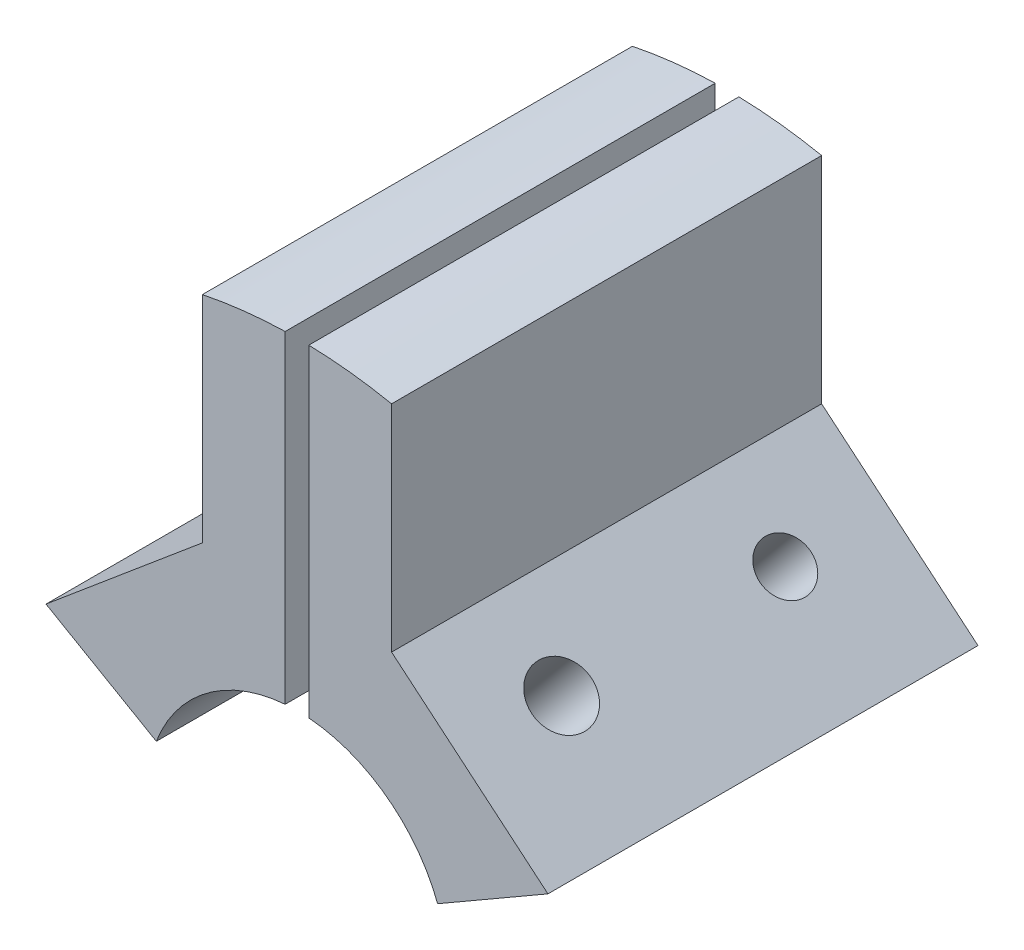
ISO-10303-21;
HEADER;
FILE_DESCRIPTION(('STEP AP214'),'2;1');
FILE_NAME('part.step','',(''),(''),'','','');
FILE_SCHEMA(('AUTOMOTIVE_DESIGN { 1 0 10303 214 1 1 1 1 }'));
ENDSEC;
DATA;
#1=APPLICATION_CONTEXT('core data for automotive mechanical design processes');
#2=APPLICATION_PROTOCOL_DEFINITION('international standard','automotive_design',2000,#1);
#3=PRODUCT_CONTEXT('',#1,'mechanical');
#4=PRODUCT('Part','Part','',(#3));
#5=PRODUCT_RELATED_PRODUCT_CATEGORY('part','',(#4));
#6=PRODUCT_DEFINITION_FORMATION('','',#4);
#7=PRODUCT_DEFINITION_CONTEXT('part definition',#1,'design');
#8=PRODUCT_DEFINITION('design','',#6,#7);
#9=PRODUCT_DEFINITION_SHAPE('','',#8);
#10=(LENGTH_UNIT() NAMED_UNIT(*) SI_UNIT(.MILLI.,.METRE.));
#11=(NAMED_UNIT(*) PLANE_ANGLE_UNIT() SI_UNIT($,.RADIAN.));
#12=(NAMED_UNIT(*) SI_UNIT($,.STERADIAN.) SOLID_ANGLE_UNIT());
#13=UNCERTAINTY_MEASURE_WITH_UNIT(LENGTH_MEASURE(1.E-05),#10,'distance_accuracy_value','');
#14=(GEOMETRIC_REPRESENTATION_CONTEXT(3) GLOBAL_UNCERTAINTY_ASSIGNED_CONTEXT((#13)) GLOBAL_UNIT_ASSIGNED_CONTEXT((#10,
#11,#12)) REPRESENTATION_CONTEXT('',''));
#15=CARTESIAN_POINT('',(0.,0.,0.));
#16=DIRECTION('',(0.,0.,1.));
#17=DIRECTION('',(1.,0.,0.));
#18=AXIS2_PLACEMENT_3D('',#15,#16,#17);
#19=CARTESIAN_POINT('',(0.,0.,25.));
#20=DIRECTION('',(0.,0.,1.));
#21=DIRECTION('',(1.,0.,0.));
#22=AXIS2_PLACEMENT_3D('',#19,#20,#21);
#23=PLANE('',#22);
#24=CARTESIAN_POINT('',(0.,0.,25.));
#25=DIRECTION('',(0.,0.,1.));
#26=DIRECTION('',(1.,0.,0.));
#27=AXIS2_PLACEMENT_3D('',#24,#25,#26);
#28=CIRCLE('',#27,17.5);
#29=CARTESIAN_POINT('',(-1.375,17.4458985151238,25.));
#30=VERTEX_POINT('',#29);
#31=CARTESIAN_POINT('',(-16.3532279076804,6.23072523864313,25.));
#32=VERTEX_POINT('',#31);
#33=EDGE_CURVE('E323',#30,#32,#28,.T.);
#34=ORIENTED_EDGE('',*,*,#33,.F.);
#35=DIRECTION('',(0.,-1.,0.));
#36=VECTOR('',#35,1.);
#37=CARTESIAN_POINT('',(-1.37499999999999,0.,25.));
#38=LINE('',#37,#36);
#39=CARTESIAN_POINT('',(-1.375,54.9828098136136,25.));
#40=VERTEX_POINT('',#39);
#41=EDGE_CURVE('E322',#40,#30,#38,.T.);
#42=ORIENTED_EDGE('',*,*,#41,.F.);
#43=CARTESIAN_POINT('',(0.,0.,25.));
#44=DIRECTION('',(0.,0.,1.));
#45=DIRECTION('',(1.,0.,0.));
#46=AXIS2_PLACEMENT_3D('',#43,#44,#45);
#47=CIRCLE('',#46,55.);
#48=CARTESIAN_POINT('',(-11.,53.8887743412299,25.));
#49=VERTEX_POINT('',#48);
#50=EDGE_CURVE('E404',#40,#49,#47,.T.);
#51=ORIENTED_EDGE('',*,*,#50,.T.);
#52=DIRECTION('',(0.,-1.,0.));
#53=VECTOR('',#52,1.);
#54=CARTESIAN_POINT('',(-11.,0.,25.));
#55=LINE('',#54,#53);
#56=CARTESIAN_POINT('',(-11.,28.8887743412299,25.));
#57=VERTEX_POINT('',#56);
#58=EDGE_CURVE('E408',#49,#57,#55,.T.);
#59=ORIENTED_EDGE('',*,*,#58,.T.);
#60=DIRECTION('',(-0.766044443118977,-0.642787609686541,0.));
#61=VECTOR('',#60,1.);
#62=CARTESIAN_POINT('',(-18.7698794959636,22.3690713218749,25.));
#63=LINE('',#62,#61);
#64=CARTESIAN_POINT('',(-29.1783603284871,13.6353188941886,25.));
#65=VERTEX_POINT('',#64);
#66=EDGE_CURVE('E331',#57,#65,#63,.T.);
#67=ORIENTED_EDGE('',*,*,#66,.T.);
#68=DIRECTION('',(0.866025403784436,-0.500000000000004,0.));
#69=VECTOR('',#68,1.);
#70=CARTESIAN_POINT('',(-1.39032380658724,-2.40811147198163,25.));
#71=LINE('',#70,#69);
#72=EDGE_CURVE('E326',#65,#32,#71,.T.);
#73=ORIENTED_EDGE('',*,*,#72,.T.);
#74=EDGE_LOOP('',(#34,#42,#51,#59,#67,#73));
#75=FACE_BOUND('',#74,.T.);
#76=ADVANCED_FACE('F43',(#75),#23,.T.);
#77=CARTESIAN_POINT('',(0.,0.,-25.));
#78=DIRECTION('',(0.,0.,1.));
#79=DIRECTION('',(1.,0.,0.));
#80=AXIS2_PLACEMENT_3D('',#77,#78,#79);
#81=PLANE('',#80);
#82=CARTESIAN_POINT('',(0.,0.,-25.));
#83=DIRECTION('',(0.,0.,1.));
#84=DIRECTION('',(1.,0.,0.));
#85=AXIS2_PLACEMENT_3D('',#82,#83,#84);
#86=CIRCLE('',#85,55.);
#87=CARTESIAN_POINT('',(-1.375,54.9828098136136,-25.));
#88=VERTEX_POINT('',#87);
#89=CARTESIAN_POINT('',(-11.,53.8887743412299,-25.));
#90=VERTEX_POINT('',#89);
#91=EDGE_CURVE('E352',#88,#90,#86,.T.);
#92=ORIENTED_EDGE('',*,*,#91,.F.);
#93=DIRECTION('',(0.,-1.,0.));
#94=VECTOR('',#93,1.);
#95=CARTESIAN_POINT('',(-1.37499999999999,0.,-25.));
#96=LINE('',#95,#94);
#97=CARTESIAN_POINT('',(-1.375,17.4458985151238,-25.));
#98=VERTEX_POINT('',#97);
#99=EDGE_CURVE('E346',#88,#98,#96,.T.);
#100=ORIENTED_EDGE('',*,*,#99,.T.);
#101=CARTESIAN_POINT('',(0.,0.,-25.));
#102=DIRECTION('',(0.,0.,1.));
#103=DIRECTION('',(1.,0.,0.));
#104=AXIS2_PLACEMENT_3D('',#101,#102,#103);
#105=CIRCLE('',#104,17.5);
#106=CARTESIAN_POINT('',(-16.3532279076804,6.23072523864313,-25.));
#107=VERTEX_POINT('',#106);
#108=EDGE_CURVE('E354',#98,#107,#105,.T.);
#109=ORIENTED_EDGE('',*,*,#108,.T.);
#110=DIRECTION('',(0.866025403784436,-0.500000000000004,0.));
#111=VECTOR('',#110,1.);
#112=CARTESIAN_POINT('',(-1.39032380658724,-2.40811147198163,-25.));
#113=LINE('',#112,#111);
#114=CARTESIAN_POINT('',(-29.1783603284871,13.6353188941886,-25.));
#115=VERTEX_POINT('',#114);
#116=EDGE_CURVE('E359',#115,#107,#113,.T.);
#117=ORIENTED_EDGE('',*,*,#116,.F.);
#118=DIRECTION('',(-0.766044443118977,-0.642787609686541,0.));
#119=VECTOR('',#118,1.);
#120=CARTESIAN_POINT('',(-18.7698794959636,22.3690713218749,-25.));
#121=LINE('',#120,#119);
#122=CARTESIAN_POINT('',(-11.,28.8887743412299,-25.));
#123=VERTEX_POINT('',#122);
#124=EDGE_CURVE('E360',#123,#115,#121,.T.);
#125=ORIENTED_EDGE('',*,*,#124,.F.);
#126=DIRECTION('',(0.,-1.,0.));
#127=VECTOR('',#126,1.);
#128=CARTESIAN_POINT('',(-11.,0.,-25.));
#129=LINE('',#128,#127);
#130=EDGE_CURVE('E351',#90,#123,#129,.T.);
#131=ORIENTED_EDGE('',*,*,#130,.F.);
#132=EDGE_LOOP('',(#92,#100,#109,#117,#125,#131));
#133=FACE_BOUND('',#132,.T.);
#134=ADVANCED_FACE('F255',(#133),#81,.F.);
#135=CARTESIAN_POINT('',(0.,0.,25.));
#136=DIRECTION('',(0.,0.,-1.));
#137=DIRECTION('',(-1.,0.,0.));
#138=AXIS2_PLACEMENT_3D('',#135,#136,#137);
#139=CYLINDRICAL_SURFACE('',#138,55.);
#140=ORIENTED_EDGE('',*,*,#91,.T.);
#141=DIRECTION('',(0.,0.,-1.));
#142=VECTOR('',#141,1.);
#143=CARTESIAN_POINT('',(-11.,53.8887743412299,25.));
#144=LINE('',#143,#142);
#145=EDGE_CURVE('E60',#49,#90,#144,.T.);
#146=ORIENTED_EDGE('',*,*,#145,.F.);
#147=ORIENTED_EDGE('',*,*,#50,.F.);
#148=DIRECTION('',(0.,0.,-1.));
#149=VECTOR('',#148,1.);
#150=CARTESIAN_POINT('',(-1.375,54.9828098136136,25.));
#151=LINE('',#150,#149);
#152=EDGE_CURVE('E11',#40,#88,#151,.T.);
#153=ORIENTED_EDGE('',*,*,#152,.T.);
#154=EDGE_LOOP('',(#140,#146,#147,#153));
#155=FACE_BOUND('',#154,.T.);
#156=ADVANCED_FACE('F44',(#155),#139,.T.);
#157=CARTESIAN_POINT('',(-11.,0.,25.));
#158=DIRECTION('',(1.,0.,0.));
#159=DIRECTION('',(0.,1.,0.));
#160=AXIS2_PLACEMENT_3D('',#157,#158,#159);
#161=PLANE('',#160);
#162=ORIENTED_EDGE('',*,*,#130,.T.);
#163=DIRECTION('',(0.,0.,-1.));
#164=VECTOR('',#163,1.);
#165=CARTESIAN_POINT('',(-11.,28.8887743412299,25.));
#166=LINE('',#165,#164);
#167=EDGE_CURVE('E217',#57,#123,#166,.T.);
#168=ORIENTED_EDGE('',*,*,#167,.F.);
#169=ORIENTED_EDGE('',*,*,#58,.F.);
#170=ORIENTED_EDGE('',*,*,#145,.T.);
#171=EDGE_LOOP('',(#162,#168,#169,#170));
#172=FACE_BOUND('',#171,.T.);
#173=ADVANCED_FACE('F424',(#172),#161,.F.);
#174=CARTESIAN_POINT('',(-18.7698794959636,22.3690713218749,25.));
#175=DIRECTION('',(0.642787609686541,-0.766044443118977,0.));
#176=DIRECTION('',(0.766044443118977,0.642787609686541,0.));
#177=AXIS2_PLACEMENT_3D('',#174,#175,#176);
#178=PLANE('',#177);
#179=CARTESIAN_POINT('',(-18.7698794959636,22.3690713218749,13.));
#180=DIRECTION('',(-0.642787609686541,0.766044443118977,0.));
#181=DIRECTION('',(-0.766044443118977,-0.642787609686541,0.));
#182=AXIS2_PLACEMENT_3D('',#179,#180,#181);
#183=CIRCLE('',#182,3.);
#184=CARTESIAN_POINT('',(-21.0680128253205,20.4407084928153,13.));
#185=VERTEX_POINT('',#184);
#186=EDGE_CURVE('E227',#185,#185,#183,.T.);
#187=ORIENTED_EDGE('',*,*,#186,.F.);
#188=EDGE_LOOP('',(#187));
#189=FACE_BOUND('',#188,.T.);
#190=CARTESIAN_POINT('',(-18.7698794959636,22.3690713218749,-13.));
#191=DIRECTION('',(-0.642787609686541,0.766044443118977,0.));
#192=DIRECTION('',(-0.766044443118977,-0.642787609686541,0.));
#193=AXIS2_PLACEMENT_3D('',#190,#191,#192);
#194=CIRCLE('',#193,3.5);
#195=CARTESIAN_POINT('',(-21.45103504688,20.119314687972,-13.));
#196=VERTEX_POINT('',#195);
#197=EDGE_CURVE('E297',#196,#196,#194,.T.);
#198=ORIENTED_EDGE('',*,*,#197,.F.);
#199=EDGE_LOOP('',(#198));
#200=FACE_BOUND('',#199,.T.);
#201=ORIENTED_EDGE('',*,*,#124,.T.);
#202=DIRECTION('',(0.,0.,-1.));
#203=VECTOR('',#202,1.);
#204=CARTESIAN_POINT('',(-29.1783603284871,13.6353188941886,25.));
#205=LINE('',#204,#203);
#206=EDGE_CURVE('E214',#65,#115,#205,.T.);
#207=ORIENTED_EDGE('',*,*,#206,.F.);
#208=ORIENTED_EDGE('',*,*,#66,.F.);
#209=ORIENTED_EDGE('',*,*,#167,.T.);
#210=EDGE_LOOP('',(#201,#207,#208,#209));
#211=FACE_BOUND('',#210,.T.);
#212=ADVANCED_FACE('F415',(#189,#200,#211),#178,.F.);
#213=CARTESIAN_POINT('',(-1.39032380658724,-2.40811147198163,25.));
#214=DIRECTION('',(0.500000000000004,0.866025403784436,0.));
#215=DIRECTION('',(-0.866025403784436,0.500000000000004,0.));
#216=AXIS2_PLACEMENT_3D('',#213,#214,#215);
#217=PLANE('',#216);
#218=ORIENTED_EDGE('',*,*,#116,.T.);
#219=DIRECTION('',(0.,0.,-1.));
#220=VECTOR('',#219,1.);
#221=CARTESIAN_POINT('',(-16.3532279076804,6.23072523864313,25.));
#222=LINE('',#221,#220);
#223=EDGE_CURVE('E213',#32,#107,#222,.T.);
#224=ORIENTED_EDGE('',*,*,#223,.F.);
#225=ORIENTED_EDGE('',*,*,#72,.F.);
#226=ORIENTED_EDGE('',*,*,#206,.T.);
#227=EDGE_LOOP('',(#218,#224,#225,#226));
#228=FACE_BOUND('',#227,.T.);
#229=ADVANCED_FACE('F418',(#228),#217,.F.);
#230=CARTESIAN_POINT('',(0.,0.,25.));
#231=DIRECTION('',(0.,0.,-1.));
#232=DIRECTION('',(-1.,0.,0.));
#233=AXIS2_PLACEMENT_3D('',#230,#231,#232);
#234=CYLINDRICAL_SURFACE('',#233,17.5);
#235=CARTESIAN_POINT('',(-13.3803957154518,11.2789631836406,13.));
#236=CARTESIAN_POINT('',(-13.3803925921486,11.2789698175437,12.832822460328));
#237=CARTESIAN_POINT('',(-13.3712345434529,11.2898589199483,12.6655553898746));
#238=CARTESIAN_POINT('',(-13.3347302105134,11.3329491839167,12.3357195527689));
#239=CARTESIAN_POINT('',(-13.3073674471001,11.3651696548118,12.1731551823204));
#240=CARTESIAN_POINT('',(-13.2349197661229,11.4494526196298,11.8575457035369));
#241=CARTESIAN_POINT('',(-13.1898500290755,11.5014981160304,11.7044925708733));
#242=CARTESIAN_POINT('',(-13.0827184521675,11.6232104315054,11.4119792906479));
#243=CARTESIAN_POINT('',(-13.0206583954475,11.692875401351,11.2725177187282));
#244=CARTESIAN_POINT('',(-12.8798925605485,11.8477588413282,11.0096776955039));
#245=CARTESIAN_POINT('',(-12.8010368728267,11.9331163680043,10.8864614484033));
#246=CARTESIAN_POINT('',(-12.628401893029,12.1156599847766,10.6610195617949));
#247=CARTESIAN_POINT('',(-12.5346216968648,12.2128467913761,10.5587951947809));
#248=CARTESIAN_POINT('',(-12.3332938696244,12.4161356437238,10.3776271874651));
#249=CARTESIAN_POINT('',(-12.2256628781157,12.5222902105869,10.2988349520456));
#250=CARTESIAN_POINT('',(-11.9994639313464,12.7392067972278,10.167741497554));
#251=CARTESIAN_POINT('',(-11.8808967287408,12.8499684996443,10.1154384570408));
#252=CARTESIAN_POINT('',(-11.6369617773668,13.0712647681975,10.0393054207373));
#253=CARTESIAN_POINT('',(-11.5116716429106,13.1817910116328,10.0152026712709));
#254=CARTESIAN_POINT('',(-11.2566481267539,13.4002257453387,9.99530588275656));
#255=CARTESIAN_POINT('',(-11.1269150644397,13.5081344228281,9.99950981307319));
#256=CARTESIAN_POINT('',(-10.8681793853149,13.7171446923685,10.0358951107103));
#257=CARTESIAN_POINT('',(-10.7391833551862,13.818305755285,10.0677829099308));
#258=CARTESIAN_POINT('',(-10.4844757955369,14.0125456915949,10.15816805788));
#259=CARTESIAN_POINT('',(-10.3587643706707,14.1056243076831,10.2166662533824));
#260=CARTESIAN_POINT('',(-10.1139880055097,14.282161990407,10.3589007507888));
#261=CARTESIAN_POINT('',(-9.99495798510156,14.3655725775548,10.4427572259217));
#262=CARTESIAN_POINT('',(-9.76807650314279,14.520799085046,10.6332397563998));
#263=CARTESIAN_POINT('',(-9.66022599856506,14.5926140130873,10.7398677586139));
#264=CARTESIAN_POINT('',(-9.45805720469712,14.72446719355,10.9744925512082));
#265=CARTESIAN_POINT('',(-9.363930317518,14.7843425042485,11.1027459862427));
#266=CARTESIAN_POINT('',(-9.19429851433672,14.8904303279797,11.3761184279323));
#267=CARTESIAN_POINT('',(-9.11879378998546,14.9366427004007,11.5212376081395));
#268=CARTESIAN_POINT('',(-8.98922339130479,15.0149801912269,11.8245227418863));
#269=CARTESIAN_POINT('',(-8.93518433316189,15.0470878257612,11.9827046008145));
#270=CARTESIAN_POINT('',(-8.85088829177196,15.0968273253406,12.3074567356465));
#271=CARTESIAN_POINT('',(-8.82062908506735,15.1144605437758,12.4740262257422));
#272=CARTESIAN_POINT('',(-8.78539812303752,15.1349659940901,12.8085724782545));
#273=CARTESIAN_POINT('',(-8.78011186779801,15.1380218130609,12.9765049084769));
#274=CARTESIAN_POINT('',(-8.7941954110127,15.1298443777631,13.3109762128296));
#275=CARTESIAN_POINT('',(-8.81356419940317,15.118611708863,13.4775151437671));
#276=CARTESIAN_POINT('',(-8.87592829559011,15.0820812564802,13.8033231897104));
#277=CARTESIAN_POINT('',(-8.91876351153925,15.0568787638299,13.9626337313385));
#278=CARTESIAN_POINT('',(-9.02623441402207,14.9926977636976,14.2707801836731));
#279=CARTESIAN_POINT('',(-9.09087147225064,14.9537183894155,14.4196154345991));
#280=CARTESIAN_POINT('',(-9.24021488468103,14.8619029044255,14.7041803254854));
#281=CARTESIAN_POINT('',(-9.32511047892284,14.808935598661,14.839768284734));
#282=CARTESIAN_POINT('',(-9.51152330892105,14.6898987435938,15.0925224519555));
#283=CARTESIAN_POINT('',(-9.61304178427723,14.6238282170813,15.2096872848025));
#284=CARTESIAN_POINT('',(-9.83037122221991,14.4786406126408,15.4235865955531));
#285=CARTESIAN_POINT('',(-9.94632759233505,14.3993875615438,15.5200812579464));
#286=CARTESIAN_POINT('',(-10.1876671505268,14.2296581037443,15.6882185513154));
#287=CARTESIAN_POINT('',(-10.313050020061,14.139182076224,15.7598620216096));
#288=CARTESIAN_POINT('',(-10.5685047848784,13.9492616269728,15.8758931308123));
#289=CARTESIAN_POINT('',(-10.698552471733,13.8498603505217,15.9204045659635));
#290=CARTESIAN_POINT('',(-10.9597319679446,13.6441156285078,15.9813060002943));
#291=CARTESIAN_POINT('',(-11.0908636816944,13.53777278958,15.9976984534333));
#292=CARTESIAN_POINT('',(-11.34856115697,13.3224620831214,16.0018227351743));
#293=CARTESIAN_POINT('',(-11.4751638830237,13.2135452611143,15.9899188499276));
#294=CARTESIAN_POINT('',(-11.7220389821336,12.9950369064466,15.9385784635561));
#295=CARTESIAN_POINT('',(-11.8423113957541,12.8854453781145,15.89914213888));
#296=CARTESIAN_POINT('',(-12.0733533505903,12.6692211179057,15.7939992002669));
#297=CARTESIAN_POINT('',(-12.1841345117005,12.5625848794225,15.7283252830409));
#298=CARTESIAN_POINT('',(-12.3938950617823,12.3556907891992,15.5726125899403));
#299=CARTESIAN_POINT('',(-12.492873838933,12.2554332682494,15.4825725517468));
#300=CARTESIAN_POINT('',(-12.678191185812,12.0636433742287,15.2794002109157));
#301=CARTESIAN_POINT('',(-12.7643624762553,11.972231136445,15.1660018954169));
#302=CARTESIAN_POINT('',(-12.921071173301,11.802934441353,14.9198890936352));
#303=CARTESIAN_POINT('',(-12.9916049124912,11.7250531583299,14.7871700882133));
#304=CARTESIAN_POINT('',(-13.116297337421,11.5854046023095,14.5049934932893));
#305=CARTESIAN_POINT('',(-13.1703286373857,11.5237631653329,14.3554173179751));
#306=CARTESIAN_POINT('',(-13.2603545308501,11.4200592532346,14.0446231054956));
#307=CARTESIAN_POINT('',(-13.2963669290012,11.3779774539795,13.8834167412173));
#308=CARTESIAN_POINT('',(-13.3421437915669,11.3242231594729,13.601345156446));
#309=CARTESIAN_POINT('',(-13.3564746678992,11.307289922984,13.482176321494));
#310=CARTESIAN_POINT('',(-13.3756016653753,11.2846576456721,13.2420206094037));
#311=CARTESIAN_POINT('',(-13.3803979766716,11.2789583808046,13.1210337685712));
#312=CARTESIAN_POINT('',(-13.3803957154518,11.2789631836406,13.));
#313=B_SPLINE_CURVE_WITH_KNOTS('',3,(#235,#236,#237,#238,#239,#240,#241,#242,#243,#244,#245,
#246,#247,#248,#249,#250,#251,#252,#253,#254,#255,#256,#257,#258,#259,#260,#261,#262,#263,#264,
#265,#266,#267,#268,#269,#270,#271,#272,#273,#274,#275,#276,#277,#278,#279,#280,#281,#282,#283,
#284,#285,#286,#287,#288,#289,#290,#291,#292,#293,#294,#295,#296,#297,#298,#299,#300,#301,#302,
#303,#304,#305,#306,#307,#308,#309,#310,#311,#312),.UNSPECIFIED.,.T.,.F.,(4,2,2,2,2,2,2,2,2,2,2,
2,2,2,2,2,2,2,2,2,2,2,2,2,2,2,2,2,2,2,2,2,2,2,2,2,2,2,4),(0.,0.501089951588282,1.00263411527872,
1.50374923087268,2.00481177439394,2.51054946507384,3.01631780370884,3.52528645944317,
4.03422011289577,4.53818955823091,5.04212285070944,5.54077666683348,6.03944635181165,
6.54051729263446,7.04163109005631,7.54917511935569,8.05672437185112,8.56490100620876,
9.07303011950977,9.57474267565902,10.076434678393,10.5747459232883,11.0730885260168,
11.576282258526,12.0795135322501,12.588300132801,13.0970695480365,13.6034998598,
14.1098859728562,14.6097882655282,15.1096873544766,15.6089654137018,16.1082693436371,
16.6136095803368,17.1190682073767,17.6283353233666,18.1370982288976,18.4998862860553,
18.8626671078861),.UNSPECIFIED.);
#314=CARTESIAN_POINT('',(-13.3803957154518,11.2789631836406,13.));
#315=VERTEX_POINT('',#314);
#316=EDGE_CURVE('E50',#315,#315,#313,.T.);
#317=ORIENTED_EDGE('',*,*,#316,.F.);
#318=EDGE_LOOP('',(#317));
#319=FACE_BOUND('',#318,.T.);
#320=CARTESIAN_POINT('',(-13.7026671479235,10.885169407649,-13.));
#321=CARTESIAN_POINT('',(-13.702664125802,10.8851769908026,-13.194475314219));
#322=CARTESIAN_POINT('',(-13.692358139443,10.8981857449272,-13.3890411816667));
#323=CARTESIAN_POINT('',(-13.6512601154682,10.9496182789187,-13.772668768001));
#324=CARTESIAN_POINT('',(-13.620451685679,10.9880623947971,-13.9617259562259));
#325=CARTESIAN_POINT('',(-13.538812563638,11.0884945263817,-14.3287305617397));
#326=CARTESIAN_POINT('',(-13.4880017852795,11.1504591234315,-14.5066888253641));
#327=CARTESIAN_POINT('',(-13.3670576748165,11.2951591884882,-14.8468619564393));
#328=CARTESIAN_POINT('',(-13.2969254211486,11.3778934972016,-15.0090777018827));
#329=CARTESIAN_POINT('',(-13.137289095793,11.5618602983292,-15.3154635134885));
#330=CARTESIAN_POINT('',(-13.0475505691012,11.6633141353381,-15.4593785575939));
#331=CARTESIAN_POINT('',(-12.8505896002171,11.8799722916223,-15.7228513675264));
#332=CARTESIAN_POINT('',(-12.7433659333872,11.9951775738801,-15.8424074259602));
#333=CARTESIAN_POINT('',(-12.5122681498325,12.2360615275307,-16.0547580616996));
#334=CARTESIAN_POINT('',(-12.3882570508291,12.3618227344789,-16.1473102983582));
#335=CARTESIAN_POINT('',(-12.1268742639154,12.618336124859,-16.3014622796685));
#336=CARTESIAN_POINT('',(-11.9895038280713,12.7490878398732,-16.3630649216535));
#337=CARTESIAN_POINT('',(-11.7066009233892,13.0093015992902,-16.4527751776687));
#338=CARTESIAN_POINT('',(-11.5611998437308,13.1387579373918,-16.4813134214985));
#339=CARTESIAN_POINT('',(-11.2645430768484,13.3939663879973,-16.5054283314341));
#340=CARTESIAN_POINT('',(-11.1132879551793,13.5197188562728,-16.5010081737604));
#341=CARTESIAN_POINT('',(-10.8115717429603,13.7621530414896,-16.4596583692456));
#342=CARTESIAN_POINT('',(-10.6611300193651,13.8789384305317,-16.4231925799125));
#343=CARTESIAN_POINT('',(-10.3634970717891,14.1025743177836,-16.3195223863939));
#344=CARTESIAN_POINT('',(-10.2163059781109,14.2094244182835,-16.2523167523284));
#345=CARTESIAN_POINT('',(-9.92893028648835,14.4117121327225,-16.0886448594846));
#346=CARTESIAN_POINT('',(-9.78879568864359,14.5070735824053,-15.9919968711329));
#347=CARTESIAN_POINT('',(-9.52113409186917,14.6841342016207,-15.7723182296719));
#348=CARTESIAN_POINT('',(-9.39360854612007,14.7658317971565,-15.6492845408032));
#349=CARTESIAN_POINT('',(-9.15344281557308,14.9159284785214,-15.3777823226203));
#350=CARTESIAN_POINT('',(-9.04110082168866,14.984070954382,-15.2289078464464));
#351=CARTESIAN_POINT('',(-8.83816299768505,15.1046632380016,-14.9112924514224));
#352=CARTESIAN_POINT('',(-8.74756757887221,15.1571127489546,-14.7425511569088));
#353=CARTESIAN_POINT('',(-8.59156903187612,15.2460834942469,-14.3894270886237));
#354=CARTESIAN_POINT('',(-8.52622023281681,15.2825704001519,-14.2050116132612));
#355=CARTESIAN_POINT('',(-8.4238162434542,15.3392561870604,-13.826100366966));
#356=CARTESIAN_POINT('',(-8.38675736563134,15.3594571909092,-13.6316059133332));
#357=CARTESIAN_POINT('',(-8.34298651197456,15.383276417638,-13.2416229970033));
#358=CARTESIAN_POINT('',(-8.3357661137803,15.3871724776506,-13.0462084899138));
#359=CARTESIAN_POINT('',(-8.35059989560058,15.3791270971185,-12.6568312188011));
#360=CARTESIAN_POINT('',(-8.3726524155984,15.3671865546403,-12.462868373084));
#361=CARTESIAN_POINT('',(-8.44468986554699,15.3277152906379,-12.0838097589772));
#362=CARTESIAN_POINT('',(-8.49440492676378,15.3003351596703,-11.8986467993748));
#363=CARTESIAN_POINT('',(-8.61947986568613,15.2302224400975,-11.5402785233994));
#364=CARTESIAN_POINT('',(-8.69484185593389,15.1874885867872,-11.367074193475));
#365=CARTESIAN_POINT('',(-8.86937012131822,15.086236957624,-11.0350541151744));
#366=CARTESIAN_POINT('',(-8.96883386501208,15.0275207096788,-10.8764553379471));
#367=CARTESIAN_POINT('',(-9.18728321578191,14.894969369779,-10.5804209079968));
#368=CARTESIAN_POINT('',(-9.3062708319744,14.8211327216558,-10.4429874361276));
#369=CARTESIAN_POINT('',(-9.56150223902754,14.657794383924,-10.1910310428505));
#370=CARTESIAN_POINT('',(-9.69798289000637,14.5680696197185,-10.076892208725));
#371=CARTESIAN_POINT('',(-9.98195448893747,14.3749790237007,-9.87748941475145));
#372=CARTESIAN_POINT('',(-10.129444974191,14.2716137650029,-9.79222424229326));
#373=CARTESIAN_POINT('',(-10.4295784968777,14.0537557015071,-9.65354894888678));
#374=CARTESIAN_POINT('',(-10.5821869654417,13.9393304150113,-9.59995818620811));
#375=CARTESIAN_POINT('',(-10.8883796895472,13.70148664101,-9.52558063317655));
#376=CARTESIAN_POINT('',(-11.0419638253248,13.5780692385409,-9.50478989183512));
#377=CARTESIAN_POINT('',(-11.3426999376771,13.3278193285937,-9.49675556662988));
#378=CARTESIAN_POINT('',(-11.4899173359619,13.2010836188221,-9.5089345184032));
#379=CARTESIAN_POINT('',(-11.7766134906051,12.9459724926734,-9.56521882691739));
#380=CARTESIAN_POINT('',(-11.9160923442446,12.8175970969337,-9.60932378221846));
#381=CARTESIAN_POINT('',(-12.1835474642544,12.5636432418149,-9.72795147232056));
#382=CARTESIAN_POINT('',(-12.3115491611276,12.438059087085,-9.80240482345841));
#383=CARTESIAN_POINT('',(-12.5536908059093,12.1936246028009,-9.97954284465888));
#384=CARTESIAN_POINT('',(-12.6678296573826,12.0747748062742,-10.0822297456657));
#385=CARTESIAN_POINT('',(-12.8818884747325,11.8461764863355,-10.3148678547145));
#386=CARTESIAN_POINT('',(-12.9815493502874,11.7366057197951,-10.4452321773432));
#387=CARTESIAN_POINT('',(-13.1628318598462,11.5329308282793,-10.7286758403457));
#388=CARTESIAN_POINT('',(-13.2444492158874,11.4388303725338,-10.8817605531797));
#389=CARTESIAN_POINT('',(-13.3892124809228,11.2690551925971,-11.2082776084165));
#390=CARTESIAN_POINT('',(-13.4521499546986,11.1935898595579,-11.3819113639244));
#391=CARTESIAN_POINT('',(-13.5574173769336,11.0658636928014,-11.7432647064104));
#392=CARTESIAN_POINT('',(-13.5997660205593,11.0135818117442,-11.9309713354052));
#393=CARTESIAN_POINT('',(-13.6551887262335,10.9447340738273,-12.2659185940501));
#394=CARTESIAN_POINT('',(-13.6729773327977,10.9224564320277,-12.4112489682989));
#395=CARTESIAN_POINT('',(-13.6967174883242,10.8926714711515,-12.704368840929));
#396=CARTESIAN_POINT('',(-13.7026694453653,10.8851636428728,-12.8521582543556));
#397=CARTESIAN_POINT('',(-13.7026671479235,10.885169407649,-13.));
#398=B_SPLINE_CURVE_WITH_KNOTS('',3,(#320,#321,#322,#323,#324,#325,#326,#327,#328,#329,#330,
#331,#332,#333,#334,#335,#336,#337,#338,#339,#340,#341,#342,#343,#344,#345,#346,#347,#348,#349,
#350,#351,#352,#353,#354,#355,#356,#357,#358,#359,#360,#361,#362,#363,#364,#365,#366,#367,#368,
#369,#370,#371,#372,#373,#374,#375,#376,#377,#378,#379,#380,#381,#382,#383,#384,#385,#386,#387,
#388,#389,#390,#391,#392,#393,#394,#395,#396,#397),.UNSPECIFIED.,.T.,.F.,(4,2,2,2,2,2,2,2,2,2,2,
2,2,2,2,2,2,2,2,2,2,2,2,2,2,2,2,2,2,2,2,2,2,2,2,2,2,2,4),(0.,0.582884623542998,1.16623583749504,
1.74900774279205,2.33174712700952,2.92187883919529,3.51205190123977,4.10736901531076,
4.70263038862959,5.29004871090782,5.87741042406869,6.45640763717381,7.03542801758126,
7.61809734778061,8.20083375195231,8.79372713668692,9.38663173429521,9.98080521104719,
10.5749012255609,11.1588315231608,11.7427287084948,12.3210269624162,12.8993728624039,
13.4852570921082,14.0712016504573,14.6661410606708,15.2610554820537,15.8525434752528,
16.443960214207,17.025085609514,17.6062036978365,18.1860005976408,18.7658433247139,
19.3550403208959,19.9443768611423,20.5400614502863,21.1352041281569,21.5783331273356,
22.0214468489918),.UNSPECIFIED.);
#399=CARTESIAN_POINT('',(-13.7026671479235,10.885169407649,-13.));
#400=VERTEX_POINT('',#399);
#401=EDGE_CURVE('E225',#400,#400,#398,.T.);
#402=ORIENTED_EDGE('',*,*,#401,.F.);
#403=EDGE_LOOP('',(#402));
#404=FACE_BOUND('',#403,.T.);
#405=ORIENTED_EDGE('',*,*,#108,.F.);
#406=DIRECTION('',(0.,0.,-1.));
#407=VECTOR('',#406,1.);
#408=CARTESIAN_POINT('',(-1.375,17.4458985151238,25.));
#409=LINE('',#408,#407);
#410=EDGE_CURVE('E211',#30,#98,#409,.T.);
#411=ORIENTED_EDGE('',*,*,#410,.F.);
#412=ORIENTED_EDGE('',*,*,#33,.T.);
#413=ORIENTED_EDGE('',*,*,#223,.T.);
#414=EDGE_LOOP('',(#405,#411,#412,#413));
#415=FACE_BOUND('',#414,.T.);
#416=ADVANCED_FACE('F230',(#319,#404,#415),#234,.F.);
#417=CARTESIAN_POINT('',(-1.37499999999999,0.,25.));
#418=DIRECTION('',(1.,0.,0.));
#419=DIRECTION('',(0.,1.,0.));
#420=AXIS2_PLACEMENT_3D('',#417,#418,#419);
#421=PLANE('',#420);
#422=DIRECTION('',(0.,0.,-1.));
#423=VECTOR('',#422,1.);
#424=CARTESIAN_POINT('',(-1.375,50.2828098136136,25.));
#425=LINE('',#424,#423);
#426=CARTESIAN_POINT('',(-1.375,50.2828098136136,20.3));
#427=VERTEX_POINT('',#426);
#428=CARTESIAN_POINT('',(-1.375,50.2828098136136,-20.3));
#429=VERTEX_POINT('',#428);
#430=EDGE_CURVE('E177',#427,#429,#425,.T.);
#431=ORIENTED_EDGE('',*,*,#430,.T.);
#432=DIRECTION('',(0.,1.,0.));
#433=VECTOR('',#432,1.);
#434=CARTESIAN_POINT('',(-1.375,6.23072523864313,-20.3));
#435=LINE('',#434,#433);
#436=CARTESIAN_POINT('',(-1.375,22.1458985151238,-20.3));
#437=VERTEX_POINT('',#436);
#438=EDGE_CURVE('E161',#437,#429,#435,.T.);
#439=ORIENTED_EDGE('',*,*,#438,.F.);
#440=DIRECTION('',(0.,0.,-1.));
#441=VECTOR('',#440,1.);
#442=CARTESIAN_POINT('',(-1.375,22.1458985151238,25.));
#443=LINE('',#442,#441);
#444=CARTESIAN_POINT('',(-1.375,22.1458985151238,20.3));
#445=VERTEX_POINT('',#444);
#446=EDGE_CURVE('E207',#445,#437,#443,.T.);
#447=ORIENTED_EDGE('',*,*,#446,.F.);
#448=DIRECTION('',(0.,1.,0.));
#449=VECTOR('',#448,1.);
#450=CARTESIAN_POINT('',(-1.375,6.23072523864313,20.3));
#451=LINE('',#450,#449);
#452=EDGE_CURVE('E61',#445,#427,#451,.T.);
#453=ORIENTED_EDGE('',*,*,#452,.T.);
#454=EDGE_LOOP('',(#431,#439,#447,#453));
#455=FACE_BOUND('',#454,.T.);
#456=ORIENTED_EDGE('',*,*,#99,.F.);
#457=ORIENTED_EDGE('',*,*,#152,.F.);
#458=ORIENTED_EDGE('',*,*,#41,.T.);
#459=ORIENTED_EDGE('',*,*,#410,.T.);
#460=EDGE_LOOP('',(#456,#457,#458,#459));
#461=FACE_BOUND('',#460,.T.);
#462=ADVANCED_FACE('F182',(#455,#461),#421,.T.);
#463=CARTESIAN_POINT('',(0.,22.1458985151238,25.));
#464=DIRECTION('',(0.,1.,0.));
#465=DIRECTION('',(0.,0.,1.));
#466=AXIS2_PLACEMENT_3D('',#463,#464,#465);
#467=PLANE('',#466);
#468=ORIENTED_EDGE('',*,*,#446,.T.);
#469=DIRECTION('',(1.,0.,0.));
#470=VECTOR('',#469,1.);
#471=CARTESIAN_POINT('',(0.,22.1458985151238,-20.3));
#472=LINE('',#471,#470);
#473=CARTESIAN_POINT('',(1.375,22.1458985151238,-20.3));
#474=VERTEX_POINT('',#473);
#475=EDGE_CURVE('E167',#437,#474,#472,.T.);
#476=ORIENTED_EDGE('',*,*,#475,.T.);
#477=DIRECTION('',(0.,0.,-1.));
#478=VECTOR('',#477,1.);
#479=CARTESIAN_POINT('',(1.375,22.1458985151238,25.));
#480=LINE('',#479,#478);
#481=CARTESIAN_POINT('',(1.375,22.1458985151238,20.3));
#482=VERTEX_POINT('',#481);
#483=EDGE_CURVE('E206',#482,#474,#480,.T.);
#484=ORIENTED_EDGE('',*,*,#483,.F.);
#485=DIRECTION('',(-1.,0.,0.));
#486=VECTOR('',#485,1.);
#487=CARTESIAN_POINT('',(0.,22.1458985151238,20.3));
#488=LINE('',#487,#486);
#489=EDGE_CURVE('E395',#482,#445,#488,.T.);
#490=ORIENTED_EDGE('',*,*,#489,.T.);
#491=EDGE_LOOP('',(#468,#476,#484,#490));
#492=FACE_BOUND('',#491,.T.);
#493=ADVANCED_FACE('F283',(#492),#467,.F.);
#494=CARTESIAN_POINT('',(0.,0.,25.));
#495=DIRECTION('',(0.,0.,-1.));
#496=DIRECTION('',(-1.,0.,0.));
#497=AXIS2_PLACEMENT_3D('',#494,#495,#496);
#498=CYLINDRICAL_SURFACE('',#497,17.5);
#499=CARTESIAN_POINT('',(8.34035604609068,15.3846826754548,13.));
#500=CARTESIAN_POINT('',(8.34036403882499,15.3846810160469,12.805524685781));
#501=CARTESIAN_POINT('',(8.35496477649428,15.3767905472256,12.6109588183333));
#502=CARTESIAN_POINT('',(8.41275253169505,15.3452480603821,12.227331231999));
#503=CARTESIAN_POINT('',(8.4559624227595,15.3215834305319,12.0382740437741));
#504=CARTESIAN_POINT('',(8.56904524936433,15.2586244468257,11.6712694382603));
#505=CARTESIAN_POINT('',(8.63889166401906,15.2193456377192,11.4933111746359));
#506=CARTESIAN_POINT('',(8.80239513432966,15.1253658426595,11.1531380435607));
#507=CARTESIAN_POINT('',(8.8960508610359,15.0706657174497,10.9909222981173));
#508=CARTESIAN_POINT('',(9.1049433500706,14.9454001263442,10.6845364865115));
#509=CARTESIAN_POINT('',(9.22043880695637,14.8746422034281,10.5406214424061));
#510=CARTESIAN_POINT('',(9.4680073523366,14.7182958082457,10.2771486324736));
#511=CARTESIAN_POINT('',(9.60008160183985,14.6327062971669,10.1575925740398));
#512=CARTESIAN_POINT('',(9.87743569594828,14.4469484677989,9.9452419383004));
#513=CARTESIAN_POINT('',(10.0228206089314,14.3466595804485,9.85268970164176));
#514=CARTESIAN_POINT('',(10.3208256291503,14.1337908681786,9.69853772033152));
#515=CARTESIAN_POINT('',(10.4734450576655,14.0212121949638,9.63693507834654));
#516=CARTESIAN_POINT('',(10.7788311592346,13.7877928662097,9.54722482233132));
#517=CARTESIAN_POINT('',(10.9315693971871,13.6670806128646,9.51868657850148));
#518=CARTESIAN_POINT('',(11.2344145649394,13.4192472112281,9.4945716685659));
#519=CARTESIAN_POINT('',(11.3845217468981,13.2921266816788,9.49899182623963));
#520=CARTESIAN_POINT('',(11.6756652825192,13.0370924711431,9.54034163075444));
#521=CARTESIAN_POINT('',(11.8168003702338,12.9092158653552,9.57680742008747));
#522=CARTESIAN_POINT('',(12.0887221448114,12.6549385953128,9.68047761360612));
#523=CARTESIAN_POINT('',(12.2195084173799,12.5285379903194,9.74768324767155));
#524=CARTESIAN_POINT('',(12.4686251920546,12.2806550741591,9.91135514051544));
#525=CARTESIAN_POINT('',(12.5868720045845,12.1592087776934,10.0080031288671));
#526=CARTESIAN_POINT('',(12.8077216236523,11.9263598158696,10.2276817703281));
#527=CARTESIAN_POINT('',(12.9103226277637,11.8149583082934,10.3507154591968));
#528=CARTESIAN_POINT('',(13.0998433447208,11.6045052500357,10.6222176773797));
#529=CARTESIAN_POINT('',(13.1864585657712,11.5057028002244,10.7710921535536));
#530=CARTESIAN_POINT('',(13.3404585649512,11.3267886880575,11.0887075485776));
#531=CARTESIAN_POINT('',(13.4078429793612,11.2466773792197,11.2574488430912));
#532=CARTESIAN_POINT('',(13.5225509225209,11.108498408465,11.6105729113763));
#533=CARTESIAN_POINT('',(13.5698312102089,11.0504782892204,11.7949883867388));
#534=CARTESIAN_POINT('',(13.6434380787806,10.959473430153,12.173899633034));
#535=CARTESIAN_POINT('',(13.66976739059,10.9264854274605,12.3683940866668));
#536=CARTESIAN_POINT('',(13.7008254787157,10.8875157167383,12.7583770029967));
#537=CARTESIAN_POINT('',(13.7059161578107,10.881081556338,12.9537915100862));
#538=CARTESIAN_POINT('',(13.6954171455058,10.8942929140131,13.3431687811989));
#539=CARTESIAN_POINT('',(13.6798286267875,10.9139369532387,13.537131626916));
#540=CARTESIAN_POINT('',(13.6284478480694,10.978025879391,13.9161902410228));
#541=CARTESIAN_POINT('',(13.5928507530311,11.022231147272,14.1013532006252));
#542=CARTESIAN_POINT('',(13.5020841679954,11.1332309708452,14.4597214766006));
#543=CARTESIAN_POINT('',(13.4469130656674,11.2000273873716,14.632925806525));
#544=CARTESIAN_POINT('',(13.3168931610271,11.3543220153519,14.9649458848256));
#545=CARTESIAN_POINT('',(13.2417972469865,11.4420787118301,15.1235446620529));
#546=CARTESIAN_POINT('',(13.0733263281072,11.6341920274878,15.4195790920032));
#547=CARTESIAN_POINT('',(12.9799494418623,11.7385503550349,15.5570125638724));
#548=CARTESIAN_POINT('',(12.7747721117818,11.9615408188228,15.8089689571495));
#549=CARTESIAN_POINT('',(12.6627108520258,12.080367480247,15.923107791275));
#550=CARTESIAN_POINT('',(12.4232425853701,12.3264950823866,16.1225105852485));
#551=CARTESIAN_POINT('',(12.295836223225,12.4537956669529,16.2077757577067));
#552=CARTESIAN_POINT('',(12.0291702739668,12.7115388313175,16.3464510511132));
#553=CARTESIAN_POINT('',(11.8899831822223,12.8419590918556,16.4000418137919));
#554=CARTESIAN_POINT('',(11.6025829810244,13.1021989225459,16.4744193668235));
#555=CARTESIAN_POINT('',(11.4543709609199,13.2320185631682,16.4952101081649));
#556=CARTESIAN_POINT('',(11.1557006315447,13.4847303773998,16.5032444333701));
#557=CARTESIAN_POINT('',(11.0053262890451,13.6077037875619,16.4910654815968));
#558=CARTESIAN_POINT('',(10.7043066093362,13.8457448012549,16.4347811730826));
#559=CARTESIAN_POINT('',(10.5536612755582,13.960812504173,16.3906762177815));
#560=CARTESIAN_POINT('',(10.2571224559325,14.1801057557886,16.2720485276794));
#561=CARTESIAN_POINT('',(10.1112189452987,14.2843553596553,16.1975951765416));
#562=CARTESIAN_POINT('',(9.82845051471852,14.4803727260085,16.0204571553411));
#563=CARTESIAN_POINT('',(9.69158631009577,14.5721395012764,15.9177702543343));
#564=CARTESIAN_POINT('',(9.42928998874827,14.7432506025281,15.6851321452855));
#565=CARTESIAN_POINT('',(9.30407791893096,14.8223706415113,15.5547678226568));
#566=CARTESIAN_POINT('',(9.07201792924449,14.9655312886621,15.2713241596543));
#567=CARTESIAN_POINT('',(8.96517436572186,15.029568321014,15.1182394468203));
#568=CARTESIAN_POINT('',(8.77284057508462,15.1426511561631,14.7917223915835));
#569=CARTESIAN_POINT('',(8.68759275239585,15.1915280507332,14.6180886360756));
#570=CARTESIAN_POINT('',(8.54352753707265,15.2730168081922,14.2567352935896));
#571=CARTESIAN_POINT('',(8.48468617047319,15.3056434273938,14.0690286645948));
#572=CARTESIAN_POINT('',(8.40726033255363,15.3482688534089,13.7340814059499));
#573=CARTESIAN_POINT('',(8.38223217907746,15.3619187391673,13.5887510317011));
#574=CARTESIAN_POINT('',(8.34877728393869,15.3801261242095,13.295631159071));
#575=CARTESIAN_POINT('',(8.34034996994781,15.3846839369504,13.1478417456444));
#576=CARTESIAN_POINT('',(8.34035604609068,15.3846826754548,13.));
#577=B_SPLINE_CURVE_WITH_KNOTS('',3,(#499,#500,#501,#502,#503,#504,#505,#506,#507,#508,#509,
#510,#511,#512,#513,#514,#515,#516,#517,#518,#519,#520,#521,#522,#523,#524,#525,#526,#527,#528,
#529,#530,#531,#532,#533,#534,#535,#536,#537,#538,#539,#540,#541,#542,#543,#544,#545,#546,#547,
#548,#549,#550,#551,#552,#553,#554,#555,#556,#557,#558,#559,#560,#561,#562,#563,#564,#565,#566,
#567,#568,#569,#570,#571,#572,#573,#574,#575,#576),.UNSPECIFIED.,.T.,.F.,(4,2,2,2,2,2,2,2,2,2,2,
2,2,2,2,2,2,2,2,2,2,2,2,2,2,2,2,2,2,2,2,2,2,2,2,2,2,2,4),(0.,0.582884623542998,1.16623583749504,
1.74900774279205,2.33174712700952,2.92187883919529,3.51205190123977,4.10736901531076,
4.70263038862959,5.29004871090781,5.87741042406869,6.45640763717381,7.03542801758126,
7.61809734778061,8.20083375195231,8.79372713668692,9.38663173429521,9.98080521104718,
10.5749012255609,11.1588315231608,11.7427287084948,12.3210269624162,12.8993728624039,
13.4852570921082,14.0712016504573,14.6661410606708,15.2610554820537,15.8525434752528,
16.443960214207,17.025085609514,17.6062036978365,18.1860005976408,18.7658433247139,
19.3550403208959,19.9443768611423,20.5400614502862,21.1352041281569,21.5783331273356,
22.0214468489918),.UNSPECIFIED.);
#578=CARTESIAN_POINT('',(8.34035604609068,15.3846826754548,13.));
#579=VERTEX_POINT('',#578);
#580=EDGE_CURVE('E292',#579,#579,#577,.T.);
#581=ORIENTED_EDGE('',*,*,#580,.F.);
#582=EDGE_LOOP('',(#581));
#583=FACE_BOUND('',#582,.T.);
#584=CARTESIAN_POINT('',(8.78412905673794,15.1356888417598,-13.));
#585=CARTESIAN_POINT('',(8.78413613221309,15.1356869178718,-13.167177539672));
#586=CARTESIAN_POINT('',(8.79645008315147,15.1285588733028,-13.3344446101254));
#587=CARTESIAN_POINT('',(8.84522462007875,15.1000916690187,-13.6642804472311));
#588=CARTESIAN_POINT('',(8.88170708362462,15.07873963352,-13.8268448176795));
#589=CARTESIAN_POINT('',(8.97729000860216,15.0220281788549,-14.1424542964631));
#590=CARTESIAN_POINT('',(9.03637109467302,14.9866807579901,-14.2955074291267));
#591=CARTESIAN_POINT('',(9.17483752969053,14.9023118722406,-14.5880207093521));
#592=CARTESIAN_POINT('',(9.25422074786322,14.8532918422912,-14.7274822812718));
#593=CARTESIAN_POINT('',(9.43119489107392,14.7415597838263,-14.9903223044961));
#594=CARTESIAN_POINT('',(9.52894879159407,14.6787242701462,-15.1135385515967));
#595=CARTESIAN_POINT('',(9.73869691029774,14.5404103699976,-15.3389804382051));
#596=CARTESIAN_POINT('',(9.85069199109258,14.4649312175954,-15.4412048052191));
#597=CARTESIAN_POINT('',(10.0858526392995,14.3019627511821,-15.6223728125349));
#598=CARTESIAN_POINT('',(10.2090844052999,14.2144004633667,-15.7011650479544));
#599=CARTESIAN_POINT('',(10.4619845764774,14.029305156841,-15.832258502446));
#600=CARTESIAN_POINT('',(10.5916525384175,13.931772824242,-15.8845615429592));
#601=CARTESIAN_POINT('',(10.8519456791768,13.7299714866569,-15.9606945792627));
#602=CARTESIAN_POINT('',(10.9825491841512,13.6257774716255,-15.9847973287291));
#603=CARTESIAN_POINT('',(11.2419497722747,13.4125591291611,-16.0046941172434));
#604=CARTESIAN_POINT('',(11.3707469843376,13.3035351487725,-16.0004901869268));
#605=CARTESIAN_POINT('',(11.6215108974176,13.0850244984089,-15.9641048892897));
#606=CARTESIAN_POINT('',(11.7435350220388,12.9755546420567,-15.9322170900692));
#607=CARTESIAN_POINT('',(11.9790535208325,12.7584460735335,-15.84183194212));
#608=CARTESIAN_POINT('',(12.0925476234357,12.6508074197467,-15.7833337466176));
#609=CARTESIAN_POINT('',(12.3089082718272,12.4404052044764,-15.6410992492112));
#610=CARTESIAN_POINT('',(12.4117210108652,12.3376676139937,-15.5572427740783));
#611=CARTESIAN_POINT('',(12.603986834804,12.1411877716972,-15.3667602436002));
#612=CARTESIAN_POINT('',(12.6934387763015,12.0474462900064,-15.2601322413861));
#613=CARTESIAN_POINT('',(12.8583950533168,11.8712449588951,-15.0255074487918));
#614=CARTESIAN_POINT('',(12.9337056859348,11.7889453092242,-14.8972540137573));
#615=CARTESIAN_POINT('',(13.0676380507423,11.6403125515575,-14.6238815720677));
#616=CARTESIAN_POINT('',(13.1262596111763,11.5739796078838,-14.4787623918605));
#617=CARTESIAN_POINT('',(13.225906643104,11.4599808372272,-14.1754772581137));
#618=CARTESIAN_POINT('',(13.2669102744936,11.4123381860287,-14.0172953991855));
#619=CARTESIAN_POINT('',(13.3305319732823,11.3379599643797,-13.6925432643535));
#620=CARTESIAN_POINT('',(13.3531517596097,11.3112224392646,-13.5259737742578));
#621=CARTESIAN_POINT('',(13.3794634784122,11.2800874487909,-13.1914275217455));
#622=CARTESIAN_POINT('',(13.3833908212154,11.2754121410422,-13.0234950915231));
#623=CARTESIAN_POINT('',(13.3728920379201,11.2878617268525,-12.6890237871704));
#624=CARTESIAN_POINT('',(13.3584666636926,11.304985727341,-12.5224848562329));
#625=CARTESIAN_POINT('',(13.3116617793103,11.3600589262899,-12.1966768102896));
#626=CARTESIAN_POINT('',(13.2794039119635,11.3978670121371,-12.0373662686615));
#627=CARTESIAN_POINT('',(13.1975358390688,11.4925602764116,-11.7292198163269));
#628=CARTESIAN_POINT('',(13.147924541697,11.5494466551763,-11.5803845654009));
#629=CARTESIAN_POINT('',(13.0315707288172,11.680577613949,-11.2958196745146));
#630=CARTESIAN_POINT('',(12.9646661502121,11.754985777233,-11.160231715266));
#631=CARTESIAN_POINT('',(12.8150674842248,11.9178960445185,-10.9074775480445));
#632=CARTESIAN_POINT('',(12.7323722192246,12.0063991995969,-10.7903127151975));
#633=CARTESIAN_POINT('',(12.5516514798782,12.1952153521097,-10.5764134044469));
#634=CARTESIAN_POINT('',(12.4534668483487,12.2956479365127,-10.4799187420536));
#635=CARTESIAN_POINT('',(12.2444077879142,12.5038477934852,-10.3117814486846));
#636=CARTESIAN_POINT('',(12.1335337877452,12.6116148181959,-10.2401379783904));
#637=CARTESIAN_POINT('',(11.9021394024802,12.8302093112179,-10.1241068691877));
#638=CARTESIAN_POINT('',(11.7816657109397,12.9410204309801,-10.0795954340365));
#639=CARTESIAN_POINT('',(11.533693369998,13.1625048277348,-10.0186939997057));
#640=CARTESIAN_POINT('',(11.4061953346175,13.2731781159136,-10.0023015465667));
#641=CARTESIAN_POINT('',(11.1494069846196,13.489572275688,-9.99817726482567));
#642=CARTESIAN_POINT('',(11.0201605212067,13.5953384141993,-10.0100811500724));
#643=CARTESIAN_POINT('',(10.7621023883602,13.8005193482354,-10.0614215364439));
#644=CARTESIAN_POINT('',(10.6332907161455,13.8999341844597,-10.10085786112));
#645=CARTESIAN_POINT('',(10.3802313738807,14.0899191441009,-10.2060007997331));
#646=CARTESIAN_POINT('',(10.2559782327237,14.180500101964,-10.2716747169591));
#647=CARTESIAN_POINT('',(10.0158027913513,14.3511471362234,-10.4273874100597));
#648=CARTESIAN_POINT('',(9.89988092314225,14.4312126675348,-10.5174274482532));
#649=CARTESIAN_POINT('',(9.67882472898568,14.5804106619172,-10.7205997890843));
#650=CARTESIAN_POINT('',(9.57383776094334,14.6493992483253,-10.8339981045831));
#651=CARTESIAN_POINT('',(9.37990088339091,14.7743291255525,-11.0801109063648));
#652=CARTESIAN_POINT('',(9.29095473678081,14.8302673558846,-11.2128299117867));
#653=CARTESIAN_POINT('',(9.13177514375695,14.9288157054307,-11.4950065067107));
#654=CARTESIAN_POINT('',(9.06168774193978,14.9713222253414,-11.6445826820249));
#655=CARTESIAN_POINT('',(8.94392649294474,15.0419724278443,-11.9553768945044));
#656=CARTESIAN_POINT('',(8.89623052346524,15.0701302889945,-12.1165832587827));
#657=CARTESIAN_POINT('',(8.83534380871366,15.1058773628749,-12.3986548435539));
#658=CARTESIAN_POINT('',(8.81617929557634,15.117050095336,-12.517823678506));
#659=CARTESIAN_POINT('',(8.79056948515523,15.1319564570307,-12.7579793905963));
#660=CARTESIAN_POINT('',(8.78412393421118,15.1356902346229,-12.8789662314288));
#661=CARTESIAN_POINT('',(8.78412905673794,15.1356888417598,-13.));
#662=B_SPLINE_CURVE_WITH_KNOTS('',3,(#584,#585,#586,#587,#588,#589,#590,#591,#592,#593,#594,
#595,#596,#597,#598,#599,#600,#601,#602,#603,#604,#605,#606,#607,#608,#609,#610,#611,#612,#613,
#614,#615,#616,#617,#618,#619,#620,#621,#622,#623,#624,#625,#626,#627,#628,#629,#630,#631,#632,
#633,#634,#635,#636,#637,#638,#639,#640,#641,#642,#643,#644,#645,#646,#647,#648,#649,#650,#651,
#652,#653,#654,#655,#656,#657,#658,#659,#660,#661),.UNSPECIFIED.,.T.,.F.,(4,2,2,2,2,2,2,2,2,2,2,
2,2,2,2,2,2,2,2,2,2,2,2,2,2,2,2,2,2,2,2,2,2,2,2,2,2,2,4),(0.,0.501089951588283,1.00263411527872,
1.50374923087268,2.00481177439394,2.51054946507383,3.01631780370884,3.52528645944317,
4.03422011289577,4.53818955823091,5.04212285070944,5.54077666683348,6.03944635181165,
6.54051729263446,7.04163109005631,7.54917511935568,8.05672437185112,8.56490100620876,
9.07303011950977,9.57474267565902,10.076434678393,10.5747459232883,11.0730885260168,
11.576282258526,12.0795135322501,12.588300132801,13.0970695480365,13.6034998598,
14.1098859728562,14.6097882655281,15.1096873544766,15.6089654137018,16.1082693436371,
16.6136095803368,17.1190682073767,17.6283353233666,18.1370982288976,18.4998862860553,
18.8626671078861),.UNSPECIFIED.);
#663=CARTESIAN_POINT('',(8.78412905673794,15.1356888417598,-13.));
#664=VERTEX_POINT('',#663);
#665=EDGE_CURVE('E281',#664,#664,#662,.T.);
#666=ORIENTED_EDGE('',*,*,#665,.F.);
#667=EDGE_LOOP('',(#666));
#668=FACE_BOUND('',#667,.T.);
#669=CARTESIAN_POINT('',(0.,0.,-25.));
#670=DIRECTION('',(0.,0.,1.));
#671=DIRECTION('',(1.,0.,0.));
#672=AXIS2_PLACEMENT_3D('',#669,#670,#671);
#673=CIRCLE('',#672,17.5);
#674=CARTESIAN_POINT('',(16.3532279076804,6.23072523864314,-25.));
#675=VERTEX_POINT('',#674);
#676=CARTESIAN_POINT('',(1.375,17.4458985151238,-25.));
#677=VERTEX_POINT('',#676);
#678=EDGE_CURVE('E353',#675,#677,#673,.T.);
#679=ORIENTED_EDGE('',*,*,#678,.F.);
#680=DIRECTION('',(0.,0.,-1.));
#681=VECTOR('',#680,1.);
#682=CARTESIAN_POINT('',(16.3532279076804,6.23072523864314,25.));
#683=LINE('',#682,#681);
#684=CARTESIAN_POINT('',(16.3532279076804,6.23072523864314,25.));
#685=VERTEX_POINT('',#684);
#686=EDGE_CURVE('E205',#685,#675,#683,.T.);
#687=ORIENTED_EDGE('',*,*,#686,.F.);
#688=CARTESIAN_POINT('',(0.,0.,25.));
#689=DIRECTION('',(0.,0.,1.));
#690=DIRECTION('',(1.,0.,0.));
#691=AXIS2_PLACEMENT_3D('',#688,#689,#690);
#692=CIRCLE('',#691,17.5);
#693=CARTESIAN_POINT('',(1.375,17.4458985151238,25.));
#694=VERTEX_POINT('',#693);
#695=EDGE_CURVE('E335',#685,#694,#692,.T.);
#696=ORIENTED_EDGE('',*,*,#695,.T.);
#697=DIRECTION('',(0.,0.,-1.));
#698=VECTOR('',#697,1.);
#699=CARTESIAN_POINT('',(1.375,17.4458985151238,25.));
#700=LINE('',#699,#698);
#701=EDGE_CURVE('E204',#694,#677,#700,.T.);
#702=ORIENTED_EDGE('',*,*,#701,.T.);
#703=EDGE_LOOP('',(#679,#687,#696,#702));
#704=FACE_BOUND('',#703,.T.);
#705=ADVANCED_FACE('F277',(#583,#668,#704),#498,.F.);
#706=CARTESIAN_POINT('',(1.39032380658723,-2.40811147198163,25.));
#707=DIRECTION('',(0.500000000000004,-0.866025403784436,0.));
#708=DIRECTION('',(0.866025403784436,0.500000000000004,0.));
#709=AXIS2_PLACEMENT_3D('',#706,#707,#708);
#710=PLANE('',#709);
#711=DIRECTION('',(-0.866025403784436,-0.500000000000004,0.));
#712=VECTOR('',#711,1.);
#713=CARTESIAN_POINT('',(1.39032380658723,-2.40811147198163,-25.));
#714=LINE('',#713,#712);
#715=CARTESIAN_POINT('',(29.1783603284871,13.6353188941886,-25.));
#716=VERTEX_POINT('',#715);
#717=EDGE_CURVE('E369',#716,#675,#714,.T.);
#718=ORIENTED_EDGE('',*,*,#717,.F.);
#719=DIRECTION('',(0.,0.,-1.));
#720=VECTOR('',#719,1.);
#721=CARTESIAN_POINT('',(29.1783603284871,13.6353188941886,25.));
#722=LINE('',#721,#720);
#723=CARTESIAN_POINT('',(29.1783603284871,13.6353188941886,25.));
#724=VERTEX_POINT('',#723);
#725=EDGE_CURVE('E199',#724,#716,#722,.T.);
#726=ORIENTED_EDGE('',*,*,#725,.F.);
#727=DIRECTION('',(-0.866025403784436,-0.500000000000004,0.));
#728=VECTOR('',#727,1.);
#729=CARTESIAN_POINT('',(1.39032380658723,-2.40811147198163,25.));
#730=LINE('',#729,#728);
#731=EDGE_CURVE('E336',#724,#685,#730,.T.);
#732=ORIENTED_EDGE('',*,*,#731,.T.);
#733=ORIENTED_EDGE('',*,*,#686,.T.);
#734=EDGE_LOOP('',(#718,#726,#732,#733));
#735=FACE_BOUND('',#734,.T.);
#736=ADVANCED_FACE('F275',(#735),#710,.T.);
#737=CARTESIAN_POINT('',(18.7698794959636,22.3690713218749,25.));
#738=DIRECTION('',(0.642787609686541,0.766044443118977,0.));
#739=DIRECTION('',(-0.766044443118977,0.642787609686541,0.));
#740=AXIS2_PLACEMENT_3D('',#737,#738,#739);
#741=PLANE('',#740);
#742=CARTESIAN_POINT('',(18.7698794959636,22.3690713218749,13.));
#743=DIRECTION('',(0.642787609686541,0.766044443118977,0.));
#744=DIRECTION('',(-0.766044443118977,0.642787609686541,0.));
#745=AXIS2_PLACEMENT_3D('',#742,#743,#744);
#746=CIRCLE('',#745,3.5);
#747=CARTESIAN_POINT('',(16.0887239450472,24.6188279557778,13.));
#748=VERTEX_POINT('',#747);
#749=EDGE_CURVE('E657',#748,#748,#746,.T.);
#750=ORIENTED_EDGE('',*,*,#749,.F.);
#751=EDGE_LOOP('',(#750));
#752=FACE_BOUND('',#751,.T.);
#753=CARTESIAN_POINT('',(18.7698794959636,22.3690713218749,-13.));
#754=DIRECTION('',(0.642787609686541,0.766044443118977,0.));
#755=DIRECTION('',(-0.766044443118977,0.642787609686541,0.));
#756=AXIS2_PLACEMENT_3D('',#753,#754,#755);
#757=CIRCLE('',#756,3.);
#758=CARTESIAN_POINT('',(16.4717461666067,24.2974341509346,-13.));
#759=VERTEX_POINT('',#758);
#760=EDGE_CURVE('E656',#759,#759,#757,.T.);
#761=ORIENTED_EDGE('',*,*,#760,.F.);
#762=EDGE_LOOP('',(#761));
#763=FACE_BOUND('',#762,.T.);
#764=DIRECTION('',(0.766044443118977,-0.642787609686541,0.));
#765=VECTOR('',#764,1.);
#766=CARTESIAN_POINT('',(18.7698794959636,22.3690713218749,-25.));
#767=LINE('',#766,#765);
#768=CARTESIAN_POINT('',(11.,28.8887743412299,-25.));
#769=VERTEX_POINT('',#768);
#770=EDGE_CURVE('E375',#769,#716,#767,.T.);
#771=ORIENTED_EDGE('',*,*,#770,.F.);
#772=DIRECTION('',(0.,0.,-1.));
#773=VECTOR('',#772,1.);
#774=CARTESIAN_POINT('',(11.,28.8887743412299,25.));
#775=LINE('',#774,#773);
#776=CARTESIAN_POINT('',(11.,28.8887743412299,25.));
#777=VERTEX_POINT('',#776);
#778=EDGE_CURVE('E196',#777,#769,#775,.T.);
#779=ORIENTED_EDGE('',*,*,#778,.F.);
#780=DIRECTION('',(0.766044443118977,-0.642787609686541,0.));
#781=VECTOR('',#780,1.);
#782=CARTESIAN_POINT('',(18.7698794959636,22.3690713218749,25.));
#783=LINE('',#782,#781);
#784=EDGE_CURVE('E343',#777,#724,#783,.T.);
#785=ORIENTED_EDGE('',*,*,#784,.T.);
#786=ORIENTED_EDGE('',*,*,#725,.T.);
#787=EDGE_LOOP('',(#771,#779,#785,#786));
#788=FACE_BOUND('',#787,.T.);
#789=ADVANCED_FACE('F268',(#752,#763,#788),#741,.T.);
#790=CARTESIAN_POINT('',(11.,0.,25.));
#791=DIRECTION('',(1.,0.,0.));
#792=DIRECTION('',(0.,1.,0.));
#793=AXIS2_PLACEMENT_3D('',#790,#791,#792);
#794=PLANE('',#793);
#795=DIRECTION('',(0.,-1.,0.));
#796=VECTOR('',#795,1.);
#797=CARTESIAN_POINT('',(11.,0.,-25.));
#798=LINE('',#797,#796);
#799=CARTESIAN_POINT('',(11.,53.8887743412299,-25.));
#800=VERTEX_POINT('',#799);
#801=EDGE_CURVE('E372',#800,#769,#798,.T.);
#802=ORIENTED_EDGE('',*,*,#801,.F.);
#803=DIRECTION('',(0.,0.,-1.));
#804=VECTOR('',#803,1.);
#805=CARTESIAN_POINT('',(11.,53.8887743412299,25.));
#806=LINE('',#805,#804);
#807=CARTESIAN_POINT('',(11.,53.8887743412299,25.));
#808=VERTEX_POINT('',#807);
#809=EDGE_CURVE('E198',#808,#800,#806,.T.);
#810=ORIENTED_EDGE('',*,*,#809,.F.);
#811=DIRECTION('',(0.,-1.,0.));
#812=VECTOR('',#811,1.);
#813=CARTESIAN_POINT('',(11.,0.,25.));
#814=LINE('',#813,#812);
#815=EDGE_CURVE('E187',#808,#777,#814,.T.);
#816=ORIENTED_EDGE('',*,*,#815,.T.);
#817=ORIENTED_EDGE('',*,*,#778,.T.);
#818=EDGE_LOOP('',(#802,#810,#816,#817));
#819=FACE_BOUND('',#818,.T.);
#820=ADVANCED_FACE('F262',(#819),#794,.T.);
#821=CARTESIAN_POINT('',(0.,0.,25.));
#822=DIRECTION('',(0.,0.,-1.));
#823=DIRECTION('',(-1.,0.,0.));
#824=AXIS2_PLACEMENT_3D('',#821,#822,#823);
#825=CYLINDRICAL_SURFACE('',#824,55.);
#826=CARTESIAN_POINT('',(0.,0.,-25.));
#827=DIRECTION('',(0.,0.,1.));
#828=DIRECTION('',(1.,0.,0.));
#829=AXIS2_PLACEMENT_3D('',#826,#827,#828);
#830=CIRCLE('',#829,55.);
#831=CARTESIAN_POINT('',(1.375,54.9828098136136,-25.));
#832=VERTEX_POINT('',#831);
#833=EDGE_CURVE('E192',#800,#832,#830,.T.);
#834=ORIENTED_EDGE('',*,*,#833,.T.);
#835=DIRECTION('',(0.,0.,-1.));
#836=VECTOR('',#835,1.);
#837=CARTESIAN_POINT('',(1.375,54.9828098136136,25.));
#838=LINE('',#837,#836);
#839=CARTESIAN_POINT('',(1.375,54.9828098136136,25.));
#840=VERTEX_POINT('',#839);
#841=EDGE_CURVE('E183',#840,#832,#838,.T.);
#842=ORIENTED_EDGE('',*,*,#841,.F.);
#843=CARTESIAN_POINT('',(0.,0.,25.));
#844=DIRECTION('',(0.,0.,1.));
#845=DIRECTION('',(1.,0.,0.));
#846=AXIS2_PLACEMENT_3D('',#843,#844,#845);
#847=CIRCLE('',#846,55.);
#848=EDGE_CURVE('E181',#808,#840,#847,.T.);
#849=ORIENTED_EDGE('',*,*,#848,.F.);
#850=ORIENTED_EDGE('',*,*,#809,.T.);
#851=EDGE_LOOP('',(#834,#842,#849,#850));
#852=FACE_BOUND('',#851,.T.);
#853=ADVANCED_FACE('F257',(#852),#825,.T.);
#854=CARTESIAN_POINT('',(1.37499999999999,0.,25.));
#855=DIRECTION('',(1.,0.,0.));
#856=DIRECTION('',(0.,1.,0.));
#857=AXIS2_PLACEMENT_3D('',#854,#855,#856);
#858=PLANE('',#857);
#859=DIRECTION('',(0.,-1.,0.));
#860=VECTOR('',#859,1.);
#861=CARTESIAN_POINT('',(1.37499999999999,0.,-25.));
#862=LINE('',#861,#860);
#863=EDGE_CURVE('E365',#832,#677,#862,.T.);
#864=ORIENTED_EDGE('',*,*,#863,.T.);
#865=ORIENTED_EDGE('',*,*,#701,.F.);
#866=DIRECTION('',(0.,-1.,0.));
#867=VECTOR('',#866,1.);
#868=CARTESIAN_POINT('',(1.37499999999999,0.,25.));
#869=LINE('',#868,#867);
#870=EDGE_CURVE('E329',#840,#694,#869,.T.);
#871=ORIENTED_EDGE('',*,*,#870,.F.);
#872=ORIENTED_EDGE('',*,*,#841,.T.);
#873=EDGE_LOOP('',(#864,#865,#871,#872));
#874=FACE_BOUND('',#873,.T.);
#875=DIRECTION('',(0.,1.,0.));
#876=VECTOR('',#875,1.);
#877=CARTESIAN_POINT('',(1.375,6.23072523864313,-20.3));
#878=LINE('',#877,#876);
#879=CARTESIAN_POINT('',(1.375,50.2828098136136,-20.3));
#880=VERTEX_POINT('',#879);
#881=EDGE_CURVE('E71',#474,#880,#878,.T.);
#882=ORIENTED_EDGE('',*,*,#881,.T.);
#883=DIRECTION('',(0.,0.,-1.));
#884=VECTOR('',#883,1.);
#885=CARTESIAN_POINT('',(1.375,50.2828098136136,25.));
#886=LINE('',#885,#884);
#887=CARTESIAN_POINT('',(1.375,50.2828098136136,20.3));
#888=VERTEX_POINT('',#887);
#889=EDGE_CURVE('E178',#888,#880,#886,.T.);
#890=ORIENTED_EDGE('',*,*,#889,.F.);
#891=DIRECTION('',(0.,1.,0.));
#892=VECTOR('',#891,1.);
#893=CARTESIAN_POINT('',(1.375,6.23072523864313,20.3));
#894=LINE('',#893,#892);
#895=EDGE_CURVE('E398',#482,#888,#894,.T.);
#896=ORIENTED_EDGE('',*,*,#895,.F.);
#897=ORIENTED_EDGE('',*,*,#483,.T.);
#898=EDGE_LOOP('',(#882,#890,#896,#897));
#899=FACE_BOUND('',#898,.T.);
#900=ADVANCED_FACE('F260',(#874,#899),#858,.F.);
#901=CARTESIAN_POINT('',(0.,50.2828098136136,25.));
#902=DIRECTION('',(0.,1.,0.));
#903=DIRECTION('',(0.,0.,1.));
#904=AXIS2_PLACEMENT_3D('',#901,#902,#903);
#905=PLANE('',#904);
#906=DIRECTION('',(1.,0.,0.));
#907=VECTOR('',#906,1.);
#908=CARTESIAN_POINT('',(-1.375,50.2828098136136,-20.3));
#909=LINE('',#908,#907);
#910=EDGE_CURVE('E163',#429,#880,#909,.T.);
#911=ORIENTED_EDGE('',*,*,#910,.F.);
#912=ORIENTED_EDGE('',*,*,#430,.F.);
#913=DIRECTION('',(-1.,0.,0.));
#914=VECTOR('',#913,1.);
#915=CARTESIAN_POINT('',(-1.375,50.2828098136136,20.3));
#916=LINE('',#915,#914);
#917=EDGE_CURVE('E179',#888,#427,#916,.T.);
#918=ORIENTED_EDGE('',*,*,#917,.F.);
#919=ORIENTED_EDGE('',*,*,#889,.T.);
#920=EDGE_LOOP('',(#911,#912,#918,#919));
#921=FACE_BOUND('',#920,.T.);
#922=ADVANCED_FACE('F175',(#921),#905,.T.);
#923=ORIENTED_EDGE('',*,*,#848,.T.);
#924=ORIENTED_EDGE('',*,*,#870,.T.);
#925=ORIENTED_EDGE('',*,*,#695,.F.);
#926=ORIENTED_EDGE('',*,*,#731,.F.);
#927=ORIENTED_EDGE('',*,*,#784,.F.);
#928=ORIENTED_EDGE('',*,*,#815,.F.);
#929=EDGE_LOOP('',(#923,#924,#925,#926,#927,#928));
#930=FACE_BOUND('',#929,.T.);
#931=ADVANCED_FACE('F250',(#930),#23,.T.);
#932=ORIENTED_EDGE('',*,*,#678,.T.);
#933=ORIENTED_EDGE('',*,*,#863,.F.);
#934=ORIENTED_EDGE('',*,*,#833,.F.);
#935=ORIENTED_EDGE('',*,*,#801,.T.);
#936=ORIENTED_EDGE('',*,*,#770,.T.);
#937=ORIENTED_EDGE('',*,*,#717,.T.);
#938=EDGE_LOOP('',(#932,#933,#934,#935,#936,#937));
#939=FACE_BOUND('',#938,.T.);
#940=ADVANCED_FACE('F247',(#939),#81,.F.);
#941=CARTESIAN_POINT('',(-1.375,6.23072523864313,20.3));
#942=DIRECTION('',(0.,0.,-1.));
#943=DIRECTION('',(-1.,0.,0.));
#944=AXIS2_PLACEMENT_3D('',#941,#942,#943);
#945=PLANE('',#944);
#946=ORIENTED_EDGE('',*,*,#895,.T.);
#947=ORIENTED_EDGE('',*,*,#917,.T.);
#948=ORIENTED_EDGE('',*,*,#452,.F.);
#949=ORIENTED_EDGE('',*,*,#489,.F.);
#950=EDGE_LOOP('',(#946,#947,#948,#949));
#951=FACE_BOUND('',#950,.T.);
#952=ADVANCED_FACE('F242',(#951),#945,.F.);
#953=CARTESIAN_POINT('',(-1.375,6.23072523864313,-20.3));
#954=DIRECTION('',(0.,0.,1.));
#955=DIRECTION('',(1.,0.,0.));
#956=AXIS2_PLACEMENT_3D('',#953,#954,#955);
#957=PLANE('',#956);
#958=ORIENTED_EDGE('',*,*,#438,.T.);
#959=ORIENTED_EDGE('',*,*,#910,.T.);
#960=ORIENTED_EDGE('',*,*,#881,.F.);
#961=ORIENTED_EDGE('',*,*,#475,.F.);
#962=EDGE_LOOP('',(#958,#959,#960,#961));
#963=FACE_BOUND('',#962,.T.);
#964=ADVANCED_FACE('F162',(#963),#957,.F.);
#965=CARTESIAN_POINT('',(8.98776235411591,-10.7111980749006,-13.));
#966=DIRECTION('',(-0.642787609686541,0.766044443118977,0.));
#967=DIRECTION('',(-0.766044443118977,-0.642787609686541,0.));
#968=AXIS2_PLACEMENT_3D('',#965,#966,#967);
#969=CYLINDRICAL_SURFACE('',#968,3.5);
#970=ORIENTED_EDGE('',*,*,#401,.T.);
#971=EDGE_LOOP('',(#970));
#972=FACE_BOUND('',#971,.T.);
#973=ORIENTED_EDGE('',*,*,#197,.T.);
#974=EDGE_LOOP('',(#973));
#975=FACE_BOUND('',#974,.T.);
#976=ADVANCED_FACE('F233',(#972,#975),#969,.F.);
#977=CARTESIAN_POINT('',(8.98776235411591,-10.7111980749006,13.));
#978=DIRECTION('',(-0.642787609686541,0.766044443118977,0.));
#979=DIRECTION('',(-0.766044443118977,-0.642787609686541,0.));
#980=AXIS2_PLACEMENT_3D('',#977,#978,#979);
#981=CYLINDRICAL_SURFACE('',#980,3.);
#982=ORIENTED_EDGE('',*,*,#316,.T.);
#983=EDGE_LOOP('',(#982));
#984=FACE_BOUND('',#983,.T.);
#985=ORIENTED_EDGE('',*,*,#186,.T.);
#986=EDGE_LOOP('',(#985));
#987=FACE_BOUND('',#986,.T.);
#988=ADVANCED_FACE('F240',(#984,#987),#981,.F.);
#989=CARTESIAN_POINT('',(-8.98776235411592,-10.7111980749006,-13.));
#990=DIRECTION('',(0.642787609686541,0.766044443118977,0.));
#991=DIRECTION('',(-0.766044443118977,0.642787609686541,0.));
#992=AXIS2_PLACEMENT_3D('',#989,#990,#991);
#993=CYLINDRICAL_SURFACE('',#992,3.);
#994=ORIENTED_EDGE('',*,*,#665,.T.);
#995=EDGE_LOOP('',(#994));
#996=FACE_BOUND('',#995,.T.);
#997=ORIENTED_EDGE('',*,*,#760,.T.);
#998=EDGE_LOOP('',(#997));
#999=FACE_BOUND('',#998,.T.);
#1000=ADVANCED_FACE('F303',(#996,#999),#993,.F.);
#1001=CARTESIAN_POINT('',(-8.98776235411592,-10.7111980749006,13.));
#1002=DIRECTION('',(0.642787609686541,0.766044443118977,0.));
#1003=DIRECTION('',(-0.766044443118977,0.642787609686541,0.));
#1004=AXIS2_PLACEMENT_3D('',#1001,#1002,#1003);
#1005=CYLINDRICAL_SURFACE('',#1004,3.5);
#1006=ORIENTED_EDGE('',*,*,#580,.T.);
#1007=EDGE_LOOP('',(#1006));
#1008=FACE_BOUND('',#1007,.T.);
#1009=ORIENTED_EDGE('',*,*,#749,.T.);
#1010=EDGE_LOOP('',(#1009));
#1011=FACE_BOUND('',#1010,.T.);
#1012=ADVANCED_FACE('F296',(#1008,#1011),#1005,.F.);
#1013=CLOSED_SHELL('',(#76,#134,#156,#173,#212,#229,#416,#462,#493,#705,#736,#789,#820,#853,
#900,#922,#931,#940,#952,#964,#976,#988,#1000,#1012));
#1014=MANIFOLD_SOLID_BREP('B2',#1013);
#1015=ADVANCED_BREP_SHAPE_REPRESENTATION('',(#18,#1014),#14);
#1016=SHAPE_DEFINITION_REPRESENTATION(#9,#1015);
ENDSEC;
END-ISO-10303-21;
